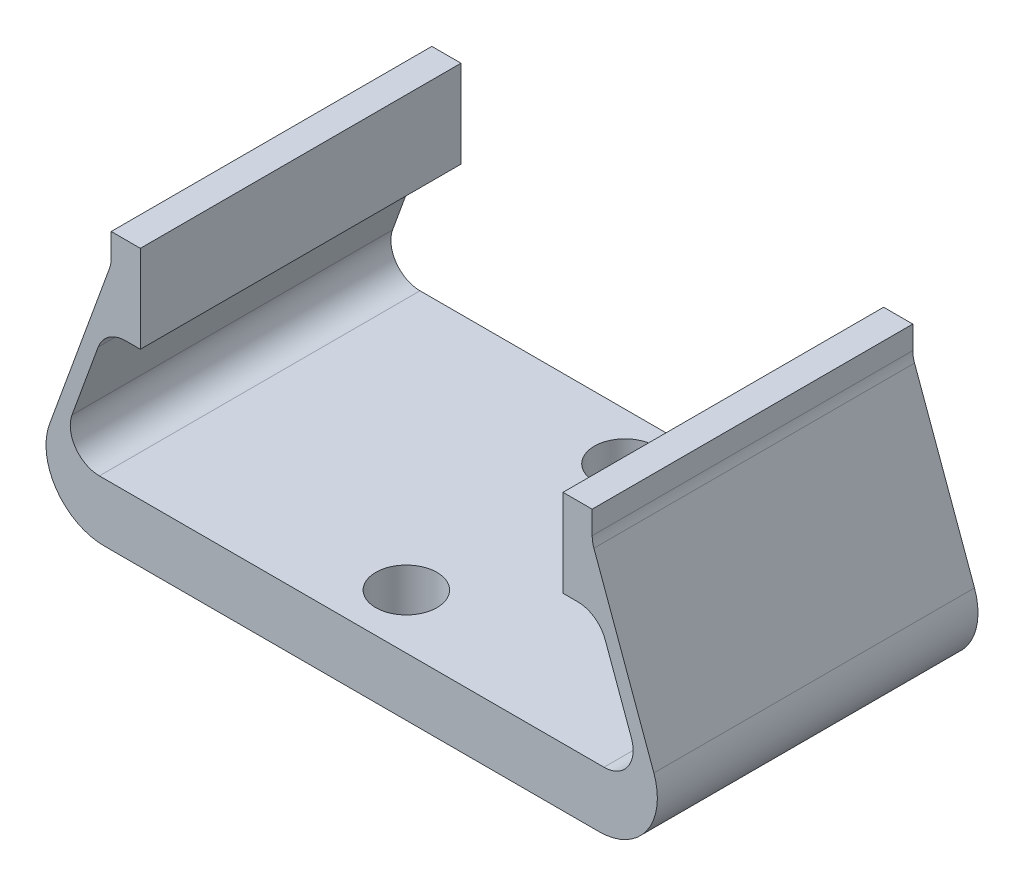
from build123d import *

# Parameters (mm, degrees)
BOSS_EXTRUDE1_DEPTH  = 22
FILLET2_R            = 4
FILLET3_R            = 2
FILLET2_OF_MIRROR1_R = 4
FILLET3_OF_MIRROR1_R = 2
SKETCH2_R            = 2.1
CUT_EXTRUDE1_DEPTH   = 36.809087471


with BuildPart() as part:
    # Sketch1 → Boss-Extrude1 (new body)
    with BuildSketch(Plane.XY):
        Polygon((0, 0), (22.687493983, 0), (16.5, 17), (16.5, 18.929982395), (14.5, 18.929982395), (14.5, 12.929982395), (16.917187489, 12.929982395), (20.167435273, 4), (0, 4), align=None)
    boss_extrude1 = extrude(amount=BOSS_EXTRUDE1_DEPTH)

    # Fillet2
    fillet2_edges = [part.edges().sort_by_distance(p)[0] for p in [
        (22.687493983, 0, 11),
    ]]
    fillet(fillet2_edges, radius=FILLET2_R)

    # Fillet3
    fillet3_edges = [part.edges().sort_by_distance(p)[0] for p in [
        (20.167435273, 4, 11),
        (16.917187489, 12.929982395, 11),
        (16.5, 17, 11),
    ]]
    fillet(fillet3_edges, radius=FILLET3_R)

    # Mirror1: Boss-Extrude1 across plane
    add(boss_extrude1.mirror(Plane(origin=(0, 0, 0), x_dir=(0, 0, 1), z_dir=(1, 0, 0))))

    # Fillet2 of Mirror1
    fillet2_of_mirror1_edges = [part.edges().sort_by_distance(p)[0] for p in [
        (-22.687493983, 0, 11),
    ]]
    fillet(fillet2_of_mirror1_edges, radius=FILLET2_OF_MIRROR1_R)

    # Fillet3 of Mirror1
    fillet3_of_mirror1_edges = [part.edges().sort_by_distance(p)[0] for p in [
        (-20.167435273, 4, 11),
        (-16.917187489, 12.929982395, 11),
        (-16.5, 17, 11),
    ]]
    fillet(fillet3_of_mirror1_edges, radius=FILLET3_OF_MIRROR1_R)

    # Sketch2 → Cut-Extrude1 (cut, through all)
    with BuildSketch(Plane.XZ):
        with Locations(Location((0, 3.25, 0), (0, 0, 270))):
            Circle(SKETCH2_R)
        with Locations(Location((0, 18.25, 0), (0, 0, 270))):
            Circle(SKETCH2_R)
    extrude(amount=-CUT_EXTRUDE1_DEPTH, mode=Mode.SUBTRACT)


solid = part.part
